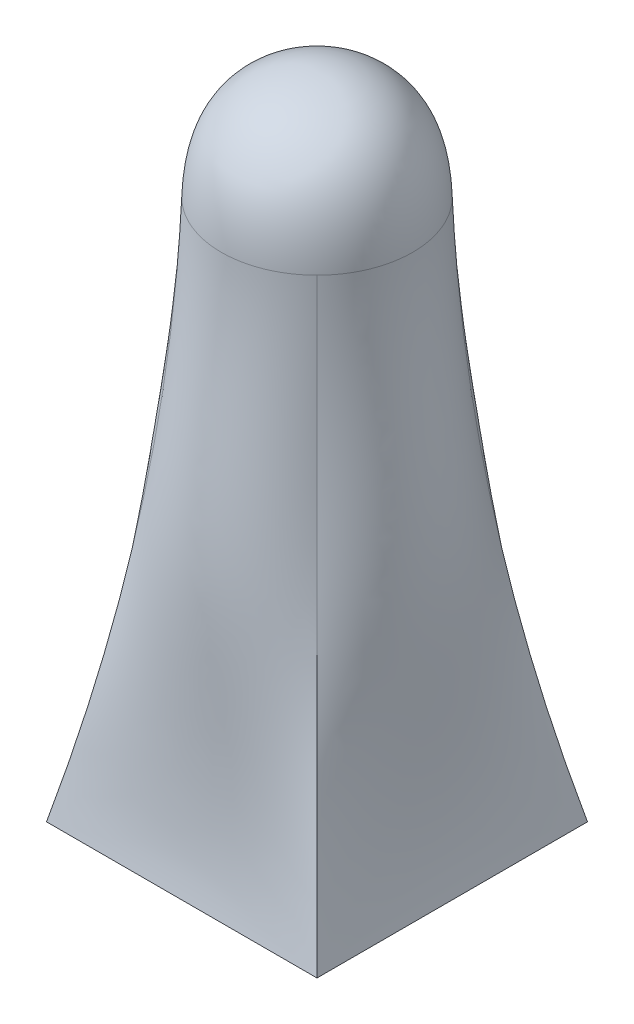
ISO-10303-21;
HEADER;
FILE_DESCRIPTION(('STEP AP214'),'2;1');
FILE_NAME('part.step','',(''),(''),'','','');
FILE_SCHEMA(('AUTOMOTIVE_DESIGN { 1 0 10303 214 1 1 1 1 }'));
ENDSEC;
DATA;
#1=APPLICATION_CONTEXT('core data for automotive mechanical design processes');
#2=APPLICATION_PROTOCOL_DEFINITION('international standard','automotive_design',2000,#1);
#3=PRODUCT_CONTEXT('',#1,'mechanical');
#4=PRODUCT('Part','Part','',(#3));
#5=PRODUCT_RELATED_PRODUCT_CATEGORY('part','',(#4));
#6=PRODUCT_DEFINITION_FORMATION('','',#4);
#7=PRODUCT_DEFINITION_CONTEXT('part definition',#1,'design');
#8=PRODUCT_DEFINITION('design','',#6,#7);
#9=PRODUCT_DEFINITION_SHAPE('','',#8);
#10=(LENGTH_UNIT() NAMED_UNIT(*) SI_UNIT(.MILLI.,.METRE.));
#11=(NAMED_UNIT(*) PLANE_ANGLE_UNIT() SI_UNIT($,.RADIAN.));
#12=(NAMED_UNIT(*) SI_UNIT($,.STERADIAN.) SOLID_ANGLE_UNIT());
#13=UNCERTAINTY_MEASURE_WITH_UNIT(LENGTH_MEASURE(1.E-05),#10,'distance_accuracy_value','');
#14=(GEOMETRIC_REPRESENTATION_CONTEXT(3) GLOBAL_UNCERTAINTY_ASSIGNED_CONTEXT((#13)) GLOBAL_UNIT_ASSIGNED_CONTEXT((#10,
#11,#12)) REPRESENTATION_CONTEXT('',''));
#15=CARTESIAN_POINT('',(0.,0.,0.));
#16=DIRECTION('',(0.,0.,1.));
#17=DIRECTION('',(1.,0.,0.));
#18=AXIS2_PLACEMENT_3D('',#15,#16,#17);
#19=CARTESIAN_POINT('',(0.,0.,0.));
#20=DIRECTION('',(0.,1.,0.));
#21=DIRECTION('',(0.,0.,1.));
#22=AXIS2_PLACEMENT_3D('',#19,#20,#21);
#23=PLANE('',#22);
#24=DIRECTION('',(0.,0.,-1.));
#25=VECTOR('',#24,1.);
#26=CARTESIAN_POINT('',(6.35,0.,-6.35));
#27=LINE('',#26,#25);
#28=CARTESIAN_POINT('',(6.35,0.,6.35));
#29=VERTEX_POINT('',#28);
#30=CARTESIAN_POINT('',(6.35,0.,-6.35));
#31=VERTEX_POINT('',#30);
#32=EDGE_CURVE('E322',#29,#31,#27,.T.);
#33=ORIENTED_EDGE('',*,*,#32,.F.);
#34=DIRECTION('',(1.,0.,0.));
#35=VECTOR('',#34,1.);
#36=CARTESIAN_POINT('',(-6.35,0.,6.35));
#37=LINE('',#36,#35);
#38=CARTESIAN_POINT('',(-6.35,0.,6.35));
#39=VERTEX_POINT('',#38);
#40=EDGE_CURVE('E279',#39,#29,#37,.T.);
#41=ORIENTED_EDGE('',*,*,#40,.F.);
#42=DIRECTION('',(0.,0.,1.));
#43=VECTOR('',#42,1.);
#44=CARTESIAN_POINT('',(-6.35,0.,-6.35));
#45=LINE('',#44,#43);
#46=CARTESIAN_POINT('',(-6.35,0.,-6.35));
#47=VERTEX_POINT('',#46);
#48=EDGE_CURVE('E256',#47,#39,#45,.T.);
#49=ORIENTED_EDGE('',*,*,#48,.F.);
#50=DIRECTION('',(-1.,0.,0.));
#51=VECTOR('',#50,1.);
#52=CARTESIAN_POINT('',(-6.35,0.,-6.35));
#53=LINE('',#52,#51);
#54=EDGE_CURVE('E264',#31,#47,#53,.T.);
#55=ORIENTED_EDGE('',*,*,#54,.F.);
#56=EDGE_LOOP('',(#33,#41,#49,#55));
#57=FACE_BOUND('',#56,.T.);
#58=ADVANCED_FACE('F205',(#57),#23,.F.);
#59=CARTESIAN_POINT('',(-6.35,0.,-6.35));
#60=CARTESIAN_POINT('',(-5.40615816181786,4.18229638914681,-5.40615816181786));
#61=CARTESIAN_POINT('',(-3.92425343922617,12.6690168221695,-3.92425343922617));
#62=CARTESIAN_POINT('',(-3.28949149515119,21.1156297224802,-3.28949149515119));
#63=CARTESIAN_POINT('',(-3.175,25.4,-3.175));
#64=CARTESIAN_POINT('',(-6.35,0.,-2.11666666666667));
#65=CARTESIAN_POINT('',(-5.40615816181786,4.18229638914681,-1.80205272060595));
#66=CARTESIAN_POINT('',(-7.59949730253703,12.6690168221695,-2.07222445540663));
#67=CARTESIAN_POINT('',(-5.04182165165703,21.1156297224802,-1.46083367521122));
#68=CARTESIAN_POINT('',(-4.92733015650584,25.4,-1.42266984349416));
#69=CARTESIAN_POINT('',(-6.35,0.,2.11666666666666));
#70=CARTESIAN_POINT('',(-5.40615816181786,4.18229638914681,1.80205272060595));
#71=CARTESIAN_POINT('',(-7.59949730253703,12.6690168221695,2.07222445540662));
#72=CARTESIAN_POINT('',(-5.04182165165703,21.1156297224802,1.46083367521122));
#73=CARTESIAN_POINT('',(-4.92733015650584,25.4,1.42266984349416));
#74=CARTESIAN_POINT('',(-6.35,0.,6.35));
#75=CARTESIAN_POINT('',(-5.40615816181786,4.18229638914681,5.40615816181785));
#76=CARTESIAN_POINT('',(-3.92425343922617,12.6690168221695,3.92425343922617));
#77=CARTESIAN_POINT('',(-3.28949149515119,21.1156297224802,3.28949149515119));
#78=CARTESIAN_POINT('',(-3.175,25.4,3.175));
#79=B_SPLINE_SURFACE_WITH_KNOTS('',3,3,((#59,#60,#61,#62,#63),(#64,#65,#66,#67,#68),(#69,#70,
#71,#72,#73),(#74,#75,#76,#77,#78)),.UNSPECIFIED.,.F.,.F.,.F.,(4,4),(4,1,4),(0.,1.),(0.,
0.502421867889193,1.),.UNSPECIFIED.);
#80=CARTESIAN_POINT('',(-6.35,0.,6.35));
#81=CARTESIAN_POINT('',(-5.40615816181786,4.18229638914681,5.40615816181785));
#82=CARTESIAN_POINT('',(-3.92425343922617,12.6690168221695,3.92425343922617));
#83=CARTESIAN_POINT('',(-3.28949149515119,21.1156297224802,3.28949149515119));
#84=CARTESIAN_POINT('',(-3.175,25.4,3.175));
#85=B_SPLINE_CURVE_WITH_KNOTS('',3,(#80,#81,#82,#83,#84),.UNSPECIFIED.,.F.,.F.,(4,1,4),(0.,
0.502421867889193,1.),.UNSPECIFIED.);
#86=CARTESIAN_POINT('',(-3.17521670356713,25.4000497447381,3.17521670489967));
#87=VERTEX_POINT('',#86);
#88=EDGE_CURVE('E263',#39,#87,#85,.T.);
#89=CARTESIAN_POINT('',(0.,25.4,0.));
#90=DIRECTION('',(0.,1.,0.));
#91=DIRECTION('',(0.,0.,1.));
#92=AXIS2_PLACEMENT_3D('',#89,#90,#91);
#93=CIRCLE('',#92,4.49012806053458);
#94=CARTESIAN_POINT('',(-3.17521670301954,25.4000497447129,-3.17521670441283));
#95=VERTEX_POINT('',#94);
#96=EDGE_CURVE('E219',#95,#87,#93,.T.);
#97=CARTESIAN_POINT('',(-6.35,0.,-6.35));
#98=CARTESIAN_POINT('',(-5.40615816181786,4.18229638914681,-5.40615816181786));
#99=CARTESIAN_POINT('',(-3.92425343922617,12.6690168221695,-3.92425343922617));
#100=CARTESIAN_POINT('',(-3.28949149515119,21.1156297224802,-3.28949149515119));
#101=CARTESIAN_POINT('',(-3.175,25.4,-3.175));
#102=B_SPLINE_CURVE_WITH_KNOTS('',3,(#97,#98,#99,#100,#101),.UNSPECIFIED.,.F.,.F.,(4,1,4),(0.,
0.502421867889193,1.),.UNSPECIFIED.);
#103=EDGE_CURVE('E251',#95,#47,#102,.F.);
#104=ORIENTED_EDGE('',*,*,#48,.T.);
#105=ORIENTED_EDGE('',*,*,#88,.T.);
#106=ORIENTED_EDGE('',*,*,#96,.F.);
#107=ORIENTED_EDGE('',*,*,#103,.T.);
#108=EDGE_LOOP('',(#104,#105,#106,#107));
#109=FACE_BOUND('',#108,.T.);
#110=ADVANCED_FACE('F253',(#109),#79,.T.);
#111=CARTESIAN_POINT('',(-6.35,0.,6.35));
#112=CARTESIAN_POINT('',(-5.40615816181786,4.18229638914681,5.40615816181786));
#113=CARTESIAN_POINT('',(-3.92425343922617,12.6690168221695,3.92425343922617));
#114=CARTESIAN_POINT('',(-3.28949149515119,21.1156297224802,3.28949149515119));
#115=CARTESIAN_POINT('',(-3.175,25.4,3.175));
#116=CARTESIAN_POINT('',(-2.11666666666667,0.,6.35));
#117=CARTESIAN_POINT('',(-1.80205272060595,4.18229638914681,5.40615816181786));
#118=CARTESIAN_POINT('',(-2.07222445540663,12.6690168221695,7.59949730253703));
#119=CARTESIAN_POINT('',(-1.46083367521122,21.1156297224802,5.04182165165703));
#120=CARTESIAN_POINT('',(-1.42266984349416,25.4,4.92733015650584));
#121=CARTESIAN_POINT('',(2.11666666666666,0.,6.35));
#122=CARTESIAN_POINT('',(1.80205272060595,4.18229638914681,5.40615816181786));
#123=CARTESIAN_POINT('',(2.07222445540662,12.6690168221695,7.59949730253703));
#124=CARTESIAN_POINT('',(1.46083367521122,21.1156297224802,5.04182165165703));
#125=CARTESIAN_POINT('',(1.42266984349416,25.4,4.92733015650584));
#126=CARTESIAN_POINT('',(6.35,0.,6.35));
#127=CARTESIAN_POINT('',(5.40615816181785,4.18229638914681,5.40615816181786));
#128=CARTESIAN_POINT('',(3.92425343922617,12.6690168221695,3.92425343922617));
#129=CARTESIAN_POINT('',(3.28949149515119,21.1156297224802,3.28949149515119));
#130=CARTESIAN_POINT('',(3.175,25.4,3.175));
#131=B_SPLINE_SURFACE_WITH_KNOTS('',3,3,((#111,#112,#113,#114,#115),(#116,#117,#118,#119,#120),
(#121,#122,#123,#124,#125),(#126,#127,#128,#129,#130)),.UNSPECIFIED.,.F.,.F.,.F.,(4,4),(4,1,4),
(0.,1.),(0.,0.502421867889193,1.),.UNSPECIFIED.);
#132=CARTESIAN_POINT('',(6.35,0.,6.35));
#133=CARTESIAN_POINT('',(5.40615816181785,4.18229638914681,5.40615816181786));
#134=CARTESIAN_POINT('',(3.92425343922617,12.6690168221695,3.92425343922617));
#135=CARTESIAN_POINT('',(3.28949149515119,21.1156297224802,3.28949149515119));
#136=CARTESIAN_POINT('',(3.175,25.4,3.175));
#137=B_SPLINE_CURVE_WITH_KNOTS('',3,(#132,#133,#134,#135,#136),.UNSPECIFIED.,.F.,.F.,(4,1,4),
(0.,0.502421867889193,1.),.UNSPECIFIED.);
#138=CARTESIAN_POINT('',(3.17521670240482,25.4000497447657,3.17521670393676));
#139=VERTEX_POINT('',#138);
#140=EDGE_CURVE('E379',#29,#139,#137,.T.);
#141=EDGE_CURVE('E227',#87,#139,#93,.T.);
#142=ORIENTED_EDGE('',*,*,#40,.T.);
#143=ORIENTED_EDGE('',*,*,#140,.T.);
#144=ORIENTED_EDGE('',*,*,#141,.F.);
#145=ORIENTED_EDGE('',*,*,#88,.F.);
#146=EDGE_LOOP('',(#142,#143,#144,#145));
#147=FACE_BOUND('',#146,.T.);
#148=ADVANCED_FACE('F426',(#147),#131,.T.);
#149=CARTESIAN_POINT('',(6.35,0.,-6.35));
#150=CARTESIAN_POINT('',(5.40615816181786,4.18229638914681,-5.40615816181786));
#151=CARTESIAN_POINT('',(3.92425343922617,12.6690168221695,-3.92425343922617));
#152=CARTESIAN_POINT('',(3.28949149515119,21.1156297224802,-3.28949149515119));
#153=CARTESIAN_POINT('',(3.175,25.4,-3.175));
#154=CARTESIAN_POINT('',(2.11666666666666,0.,-6.35));
#155=CARTESIAN_POINT('',(1.80205272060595,4.18229638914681,-5.40615816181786));
#156=CARTESIAN_POINT('',(2.07222445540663,12.6690168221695,-7.59949730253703));
#157=CARTESIAN_POINT('',(1.46083367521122,21.1156297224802,-5.04182165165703));
#158=CARTESIAN_POINT('',(1.42266984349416,25.4,-4.92733015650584));
#159=CARTESIAN_POINT('',(-2.11666666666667,0.,-6.35));
#160=CARTESIAN_POINT('',(-1.80205272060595,4.18229638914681,-5.40615816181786));
#161=CARTESIAN_POINT('',(-2.07222445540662,12.6690168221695,-7.59949730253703));
#162=CARTESIAN_POINT('',(-1.46083367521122,21.1156297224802,-5.04182165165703));
#163=CARTESIAN_POINT('',(-1.42266984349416,25.4,-4.92733015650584));
#164=CARTESIAN_POINT('',(-6.35,0.,-6.35));
#165=CARTESIAN_POINT('',(-5.40615816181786,4.18229638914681,-5.40615816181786));
#166=CARTESIAN_POINT('',(-3.92425343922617,12.6690168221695,-3.92425343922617));
#167=CARTESIAN_POINT('',(-3.28949149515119,21.1156297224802,-3.28949149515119));
#168=CARTESIAN_POINT('',(-3.175,25.4,-3.175));
#169=B_SPLINE_SURFACE_WITH_KNOTS('',3,3,((#149,#150,#151,#152,#153),(#154,#155,#156,#157,#158),
(#159,#160,#161,#162,#163),(#164,#165,#166,#167,#168)),.UNSPECIFIED.,.F.,.F.,.F.,(4,4),(4,1,4),
(0.,1.),(0.,0.502421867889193,1.),.UNSPECIFIED.);
#170=CARTESIAN_POINT('',(3.17521670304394,25.4000497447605,-3.17521670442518));
#171=VERTEX_POINT('',#170);
#172=EDGE_CURVE('E13',#171,#95,#93,.T.);
#173=CARTESIAN_POINT('',(6.35,0.,-6.35));
#174=CARTESIAN_POINT('',(5.40615816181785,4.18229638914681,-5.40615816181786));
#175=CARTESIAN_POINT('',(3.92425343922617,12.6690168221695,-3.92425343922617));
#176=CARTESIAN_POINT('',(3.28949149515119,21.1156297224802,-3.28949149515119));
#177=CARTESIAN_POINT('',(3.175,25.4,-3.175));
#178=B_SPLINE_CURVE_WITH_KNOTS('',3,(#173,#174,#175,#176,#177),.UNSPECIFIED.,.F.,.F.,(4,1,4),
(0.,0.502421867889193,1.),.UNSPECIFIED.);
#179=EDGE_CURVE('E269',#31,#171,#178,.T.);
#180=ORIENTED_EDGE('',*,*,#54,.T.);
#181=ORIENTED_EDGE('',*,*,#103,.F.);
#182=ORIENTED_EDGE('',*,*,#172,.F.);
#183=ORIENTED_EDGE('',*,*,#179,.F.);
#184=EDGE_LOOP('',(#180,#181,#182,#183));
#185=FACE_BOUND('',#184,.T.);
#186=ADVANCED_FACE('F268',(#185),#169,.T.);
#187=CARTESIAN_POINT('',(6.35,0.,6.35));
#188=CARTESIAN_POINT('',(5.40615816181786,4.18229638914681,5.40615816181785));
#189=CARTESIAN_POINT('',(3.92425343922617,12.6690168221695,3.92425343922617));
#190=CARTESIAN_POINT('',(3.28949149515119,21.1156297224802,3.28949149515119));
#191=CARTESIAN_POINT('',(3.175,25.4,3.175));
#192=CARTESIAN_POINT('',(6.35,0.,2.11666666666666));
#193=CARTESIAN_POINT('',(5.40615816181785,4.18229638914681,1.80205272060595));
#194=CARTESIAN_POINT('',(7.59949730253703,12.6690168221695,2.07222445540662));
#195=CARTESIAN_POINT('',(5.04182165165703,21.1156297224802,1.46083367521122));
#196=CARTESIAN_POINT('',(4.92733015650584,25.4,1.42266984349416));
#197=CARTESIAN_POINT('',(6.35,0.,-2.11666666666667));
#198=CARTESIAN_POINT('',(5.40615816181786,4.18229638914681,-1.80205272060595));
#199=CARTESIAN_POINT('',(7.59949730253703,12.6690168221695,-2.07222445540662));
#200=CARTESIAN_POINT('',(5.04182165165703,21.1156297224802,-1.46083367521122));
#201=CARTESIAN_POINT('',(4.92733015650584,25.4,-1.42266984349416));
#202=CARTESIAN_POINT('',(6.35,0.,-6.35));
#203=CARTESIAN_POINT('',(5.40615816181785,4.18229638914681,-5.40615816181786));
#204=CARTESIAN_POINT('',(3.92425343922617,12.6690168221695,-3.92425343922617));
#205=CARTESIAN_POINT('',(3.28949149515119,21.1156297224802,-3.28949149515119));
#206=CARTESIAN_POINT('',(3.175,25.4,-3.175));
#207=B_SPLINE_SURFACE_WITH_KNOTS('',3,3,((#187,#188,#189,#190,#191),(#192,#193,#194,#195,#196),
(#197,#198,#199,#200,#201),(#202,#203,#204,#205,#206)),.UNSPECIFIED.,.F.,.F.,.F.,(4,4),(4,1,4),
(0.,1.),(0.,0.502421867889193,1.),.UNSPECIFIED.);
#208=EDGE_CURVE('E212',#139,#171,#93,.T.);
#209=ORIENTED_EDGE('',*,*,#32,.T.);
#210=ORIENTED_EDGE('',*,*,#179,.T.);
#211=ORIENTED_EDGE('',*,*,#208,.F.);
#212=ORIENTED_EDGE('',*,*,#140,.F.);
#213=EDGE_LOOP('',(#209,#210,#211,#212));
#214=FACE_BOUND('',#213,.T.);
#215=ADVANCED_FACE('F446',(#214),#207,.T.);
#216=CARTESIAN_POINT('',(-2.77472546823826,19.5364448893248,-2.77472545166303));
#217=CARTESIAN_POINT('',(-2.76956424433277,21.7386570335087,-3.31163639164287));
#218=CARTESIAN_POINT('',(-2.4637262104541,23.3881131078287,-3.81680141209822));
#219=CARTESIAN_POINT('',(-1.80198237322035,24.4856261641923,-4.27022862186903));
#220=CARTESIAN_POINT('',(-3.58135042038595E-09,25.5804047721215,-4.71733923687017));
#221=CARTESIAN_POINT('',(1.80198237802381,24.4856261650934,-4.27022863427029));
#222=CARTESIAN_POINT('',(2.46372620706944,23.3881131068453,-3.81680142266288));
#223=CARTESIAN_POINT('',(2.76956423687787,21.738657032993,-3.31163639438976));
#224=CARTESIAN_POINT('',(2.77472545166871,19.5364448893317,-2.77472546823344));
#225=CARTESIAN_POINT('',(-3.31163639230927,21.7386570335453,-2.76956419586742));
#226=CARTESIAN_POINT('',(-3.28819963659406,23.9409250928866,-3.28819953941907));
#227=CARTESIAN_POINT('',(-2.9332033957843,25.5894077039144,-3.7879799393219));
#228=CARTESIAN_POINT('',(-2.15522649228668,26.6856171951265,-4.27082828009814));
#229=CARTESIAN_POINT('',(4.36454671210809E-09,27.7769986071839,-4.72322887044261));
#230=CARTESIAN_POINT('',(2.1552264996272,26.6856171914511,-4.27082818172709));
#231=CARTESIAN_POINT('',(2.93320336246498,25.5894077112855,-3.78798010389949));
#232=CARTESIAN_POINT('',(3.28819965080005,23.940925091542,-3.28819949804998));
#233=CARTESIAN_POINT('',(3.31163639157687,21.7386570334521,-2.76956419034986));
#234=CARTESIAN_POINT('',(-3.81680144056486,23.3881131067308,-2.46372621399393));
#235=CARTESIAN_POINT('',(-3.78797978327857,25.5894077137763,-2.93320318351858));
#236=CARTESIAN_POINT('',(-3.41950931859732,27.2346439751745,-3.41950971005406));
#237=CARTESIAN_POINT('',(-2.5231425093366,28.3293867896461,-3.88541734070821));
#238=CARTESIAN_POINT('',(1.47030958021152E-08,29.4136921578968,-4.25838603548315));
#239=CARTESIAN_POINT('',(2.52314247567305,28.3293867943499,-3.88541746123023));
#240=CARTESIAN_POINT('',(3.4195093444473,27.2346439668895,-3.41950944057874));
#241=CARTESIAN_POINT('',(3.78797979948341,25.5894077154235,-2.93320326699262));
#242=CARTESIAN_POINT('',(3.81680141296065,23.3881131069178,-2.46372623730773));
#243=CARTESIAN_POINT('',(-4.2702286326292,24.4856261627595,-1.80198244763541));
#244=CARTESIAN_POINT('',(-4.27082830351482,26.6856171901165,-2.15522680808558));
#245=CARTESIAN_POINT('',(-3.88541756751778,28.32938679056,-2.52314191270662));
#246=CARTESIAN_POINT('',(-2.78422244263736,29.404131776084,-2.7842227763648));
#247=CARTESIAN_POINT('',(-3.35392256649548E-08,30.4879133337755,-3.09212271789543));
#248=CARTESIAN_POINT('',(2.78422249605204,29.4041317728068,-2.78422265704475));
#249=CARTESIAN_POINT('',(3.88541759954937,28.3293867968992,-2.52314213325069));
#250=CARTESIAN_POINT('',(4.27082826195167,26.6856171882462,-2.15522671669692));
#251=CARTESIAN_POINT('',(4.27022864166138,24.4856261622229,-1.80198241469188));
#252=CARTESIAN_POINT('',(-4.71733921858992,25.5804047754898,6.87440618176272E-08));
#253=CARTESIAN_POINT('',(-4.72322894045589,27.7769986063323,2.24153778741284E-07));
#254=CARTESIAN_POINT('',(-4.25838572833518,29.4136921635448,-4.35288500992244E-07));
#255=CARTESIAN_POINT('',(-3.09212298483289,30.4879133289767,2.67579766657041E-07));
#256=CARTESIAN_POINT('',(5.08201731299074E-08,31.5400415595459,-1.75990394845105E-07));
#257=CARTESIAN_POINT('',(3.09212291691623,30.4879133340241,7.53846213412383E-08));
#258=CARTESIAN_POINT('',(4.25838568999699,29.4136921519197,-7.46377946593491E-08));
#259=CARTESIAN_POINT('',(4.72322903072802,27.7769986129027,3.3961655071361E-08));
#260=CARTESIAN_POINT('',(4.71733918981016,25.5804047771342,-3.8321389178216E-09));
#261=CARTESIAN_POINT('',(-4.27022862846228,24.485626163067,1.80198237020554));
#262=CARTESIAN_POINT('',(-4.2708281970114,26.6856171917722,2.1552265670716));
#263=CARTESIAN_POINT('',(-3.88541766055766,28.329386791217,2.52314235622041));
#264=CARTESIAN_POINT('',(-2.78422252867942,29.4041317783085,2.78422250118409));
#265=CARTESIAN_POINT('',(-3.0209094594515E-08,30.487913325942,3.09212291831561));
#266=CARTESIAN_POINT('',(2.78422254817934,29.4041317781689,2.78422256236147));
#267=CARTESIAN_POINT('',(3.88541768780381,28.3293867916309,2.52314223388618));
#268=CARTESIAN_POINT('',(4.27082812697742,26.6856171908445,2.15522667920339));
#269=CARTESIAN_POINT('',(4.27022865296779,24.4856261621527,1.80198242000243));
#270=CARTESIAN_POINT('',(-3.81680142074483,23.3881131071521,2.46372625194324));
#271=CARTESIAN_POINT('',(-3.78797997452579,25.58940771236,2.93320334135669));
#272=CARTESIAN_POINT('',(-3.41950927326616,27.2346439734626,3.41950939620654));
#273=CARTESIAN_POINT('',(-2.52314225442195,28.3293867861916,3.88541750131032));
#274=CARTESIAN_POINT('',(-1.94704922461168E-08,29.4136921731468,4.25838587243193));
#275=CARTESIAN_POINT('',(2.5231423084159,28.3293867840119,3.88541756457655));
#276=CARTESIAN_POINT('',(3.41950917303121,27.2346439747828,3.41950937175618));
#277=CARTESIAN_POINT('',(3.7879800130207,25.5894077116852,2.93320330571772));
#278=CARTESIAN_POINT('',(3.8168014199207,23.388113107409,2.46372623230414));
#279=CARTESIAN_POINT('',(-3.31163639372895,21.7386570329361,2.76956420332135));
#280=CARTESIAN_POINT('',(-3.28819973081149,23.9409250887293,3.28819955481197));
#281=CARTESIAN_POINT('',(-2.93320318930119,25.5894077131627,3.78797998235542));
#282=CARTESIAN_POINT('',(-2.15522665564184,26.6856171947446,4.27082822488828));
#283=CARTESIAN_POINT('',(-7.84823396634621E-09,27.7769986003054,4.72322893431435));
#284=CARTESIAN_POINT('',(2.15522664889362,26.6856171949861,4.2708281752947));
#285=CARTESIAN_POINT('',(2.93320322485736,25.5894077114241,3.78798009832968));
#286=CARTESIAN_POINT('',(3.2881997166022,23.9409250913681,3.28819948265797));
#287=CARTESIAN_POINT('',(3.31163639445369,21.7386570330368,2.76956418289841));
#288=CARTESIAN_POINT('',(-2.77472545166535,19.5364448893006,2.77472546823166));
#289=CARTESIAN_POINT('',(-2.76956418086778,21.7386570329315,3.31163639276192));
#290=CARTESIAN_POINT('',(-2.46372623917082,23.3881131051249,3.81680142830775));
#291=CARTESIAN_POINT('',(-1.80198246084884,24.4856261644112,4.27022863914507));
#292=CARTESIAN_POINT('',(4.09713316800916E-09,25.5804047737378,4.71733922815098));
#293=CARTESIAN_POINT('',(1.80198245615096,24.4856261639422,4.27022862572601));
#294=CARTESIAN_POINT('',(2.46372624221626,23.3881131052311,3.81680141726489));
#295=CARTESIAN_POINT('',(2.76956418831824,21.738657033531,3.31163639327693));
#296=CARTESIAN_POINT('',(2.7747254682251,19.5364448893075,2.77472545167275));
#297=B_SPLINE_SURFACE_WITH_KNOTS('',5,5,((#216,#217,#218,#219,#220,#221,#222,#223,#224),(#225,
#226,#227,#228,#229,#230,#231,#232,#233),(#234,#235,#236,#237,#238,#239,#240,#241,#242),(#243,
#244,#245,#246,#247,#248,#249,#250,#251),(#252,#253,#254,#255,#256,#257,#258,#259,#260),(#261,
#262,#263,#264,#265,#266,#267,#268,#269),(#270,#271,#272,#273,#274,#275,#276,#277,#278),(#279,
#280,#281,#282,#283,#284,#285,#286,#287),(#288,#289,#290,#291,#292,#293,#294,#295,#296)),
.UNSPECIFIED.,.F.,.F.,.F.,(6,3,6),(6,3,6),(-4.64742422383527,6.34159391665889E-13,
4.64742422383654),(-4.64742422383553,-1.18216547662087E-12,4.64742422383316),.UNSPECIFIED.);
#298=ORIENTED_EDGE('',*,*,#208,.T.);
#299=ORIENTED_EDGE('',*,*,#172,.T.);
#300=ORIENTED_EDGE('',*,*,#96,.T.);
#301=ORIENTED_EDGE('',*,*,#141,.T.);
#302=EDGE_LOOP('',(#298,#299,#300,#301));
#303=FACE_BOUND('',#302,.T.);
#304=ADVANCED_FACE('F207',(#303),#297,.T.);
#305=CLOSED_SHELL('',(#58,#110,#148,#186,#215,#304));
#306=MANIFOLD_SOLID_BREP('B2',#305);
#307=ADVANCED_BREP_SHAPE_REPRESENTATION('',(#18,#306),#14);
#308=SHAPE_DEFINITION_REPRESENTATION(#9,#307);
ENDSEC;
END-ISO-10303-21;
